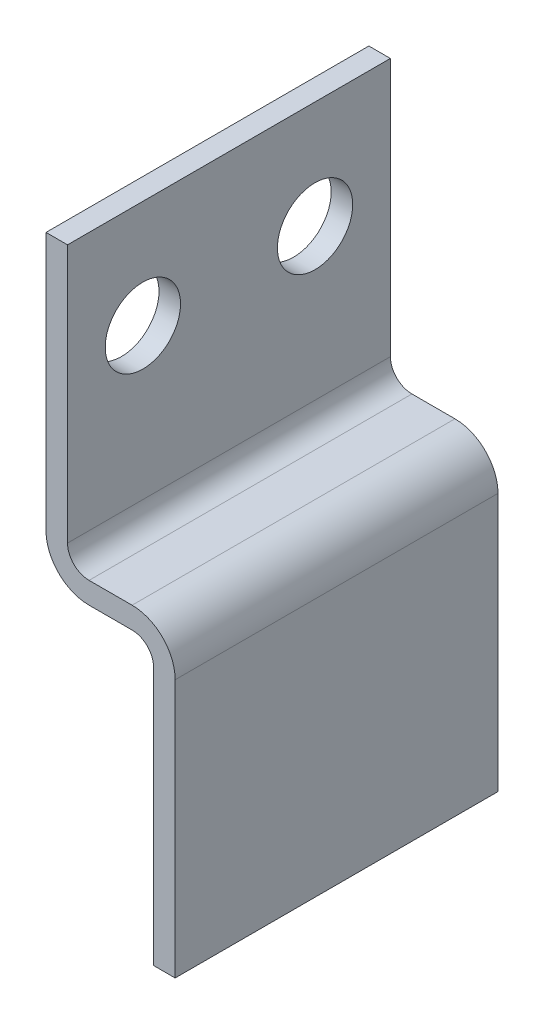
ISO-10303-21;
HEADER;
FILE_DESCRIPTION(('STEP AP214'),'2;1');
FILE_NAME('part.step','',(''),(''),'','','');
FILE_SCHEMA(('AUTOMOTIVE_DESIGN { 1 0 10303 214 1 1 1 1 }'));
ENDSEC;
DATA;
#1=APPLICATION_CONTEXT('core data for automotive mechanical design processes');
#2=APPLICATION_PROTOCOL_DEFINITION('international standard','automotive_design',2000,#1);
#3=PRODUCT_CONTEXT('',#1,'mechanical');
#4=PRODUCT('Part','Part','',(#3));
#5=PRODUCT_RELATED_PRODUCT_CATEGORY('part','',(#4));
#6=PRODUCT_DEFINITION_FORMATION('','',#4);
#7=PRODUCT_DEFINITION_CONTEXT('part definition',#1,'design');
#8=PRODUCT_DEFINITION('design','',#6,#7);
#9=PRODUCT_DEFINITION_SHAPE('','',#8);
#10=(LENGTH_UNIT() NAMED_UNIT(*) SI_UNIT(.MILLI.,.METRE.));
#11=(NAMED_UNIT(*) PLANE_ANGLE_UNIT() SI_UNIT($,.RADIAN.));
#12=(NAMED_UNIT(*) SI_UNIT($,.STERADIAN.) SOLID_ANGLE_UNIT());
#13=UNCERTAINTY_MEASURE_WITH_UNIT(LENGTH_MEASURE(1.E-05),#10,'distance_accuracy_value','');
#14=(GEOMETRIC_REPRESENTATION_CONTEXT(3) GLOBAL_UNCERTAINTY_ASSIGNED_CONTEXT((#13)) GLOBAL_UNIT_ASSIGNED_CONTEXT((#10,
#11,#12)) REPRESENTATION_CONTEXT('',''));
#15=CARTESIAN_POINT('',(0.,0.,0.));
#16=DIRECTION('',(0.,0.,1.));
#17=DIRECTION('',(1.,0.,0.));
#18=AXIS2_PLACEMENT_3D('',#15,#16,#17);
#19=CARTESIAN_POINT('',(4.,-1.,-7.5));
#20=DIRECTION('',(0.,0.,1.));
#21=DIRECTION('',(0.,-1.,0.));
#22=AXIS2_PLACEMENT_3D('',#19,#20,#21);
#23=CYLINDRICAL_SURFACE('',#22,1.);
#24=DIRECTION('',(0.,0.,-1.));
#25=VECTOR('',#24,1.);
#26=CARTESIAN_POINT('',(5.,-1.,0.));
#27=LINE('',#26,#25);
#28=CARTESIAN_POINT('',(4.999999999,-1.,7.5));
#29=VERTEX_POINT('',#28);
#30=CARTESIAN_POINT('',(4.999999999,-1.,-7.5));
#31=VERTEX_POINT('',#30);
#32=EDGE_CURVE('E105',#29,#31,#27,.T.);
#33=ORIENTED_EDGE('',*,*,#32,.F.);
#34=CARTESIAN_POINT('',(4.,-1.00000000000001,7.5));
#35=DIRECTION('',(0.,0.,1.));
#36=DIRECTION('',(0.,-1.,0.));
#37=AXIS2_PLACEMENT_3D('',#34,#35,#36);
#38=CIRCLE('',#37,1.);
#39=CARTESIAN_POINT('',(4.,-6.49999888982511E-09,7.5));
#40=VERTEX_POINT('',#39);
#41=EDGE_CURVE('E110',#29,#40,#38,.T.);
#42=ORIENTED_EDGE('',*,*,#41,.T.);
#43=DIRECTION('',(0.,0.,1.));
#44=VECTOR('',#43,1.);
#45=CARTESIAN_POINT('',(4.,0.,0.));
#46=LINE('',#45,#44);
#47=CARTESIAN_POINT('',(4.,-6.49999888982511E-09,-7.5));
#48=VERTEX_POINT('',#47);
#49=EDGE_CURVE('E108',#48,#40,#46,.T.);
#50=ORIENTED_EDGE('',*,*,#49,.F.);
#51=CARTESIAN_POINT('',(4.,-1.,-7.5));
#52=DIRECTION('',(0.,0.,1.));
#53=DIRECTION('',(0.,-1.,0.));
#54=AXIS2_PLACEMENT_3D('',#51,#52,#53);
#55=CIRCLE('',#54,1.);
#56=EDGE_CURVE('E21',#48,#31,#55,.F.);
#57=ORIENTED_EDGE('',*,*,#56,.T.);
#58=EDGE_LOOP('',(#33,#42,#50,#57));
#59=FACE_BOUND('',#58,.T.);
#60=ADVANCED_FACE('F17',(#59),#23,.F.);
#61=CARTESIAN_POINT('',(5.,-13.,7.5));
#62=DIRECTION('',(0.,-1.,0.));
#63=DIRECTION('',(0.,0.,-1.));
#64=AXIS2_PLACEMENT_3D('',#61,#62,#63);
#65=PLANE('',#64);
#66=DIRECTION('',(0.,0.,-1.));
#67=VECTOR('',#66,1.);
#68=CARTESIAN_POINT('',(6.,-13.,0.));
#69=LINE('',#68,#67);
#70=CARTESIAN_POINT('',(6.,-13.,7.5));
#71=VERTEX_POINT('',#70);
#72=CARTESIAN_POINT('',(6.,-13.,-7.5));
#73=VERTEX_POINT('',#72);
#74=EDGE_CURVE('E203',#71,#73,#69,.T.);
#75=ORIENTED_EDGE('',*,*,#74,.F.);
#76=DIRECTION('',(-1.,0.,0.));
#77=VECTOR('',#76,1.);
#78=CARTESIAN_POINT('',(5.5,-13.,7.5));
#79=LINE('',#78,#77);
#80=CARTESIAN_POINT('',(4.99999999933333,-13.,7.5));
#81=VERTEX_POINT('',#80);
#82=EDGE_CURVE('E212',#71,#81,#79,.T.);
#83=ORIENTED_EDGE('',*,*,#82,.T.);
#84=DIRECTION('',(0.,0.,1.));
#85=VECTOR('',#84,1.);
#86=CARTESIAN_POINT('',(5.,-13.,0.));
#87=LINE('',#86,#85);
#88=CARTESIAN_POINT('',(4.99999999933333,-13.,-7.5));
#89=VERTEX_POINT('',#88);
#90=EDGE_CURVE('E118',#89,#81,#87,.T.);
#91=ORIENTED_EDGE('',*,*,#90,.F.);
#92=DIRECTION('',(1.,0.,0.));
#93=VECTOR('',#92,1.);
#94=CARTESIAN_POINT('',(5.5,-13.,-7.5));
#95=LINE('',#94,#93);
#96=EDGE_CURVE('E122',#89,#73,#95,.T.);
#97=ORIENTED_EDGE('',*,*,#96,.T.);
#98=EDGE_LOOP('',(#75,#83,#91,#97));
#99=FACE_BOUND('',#98,.T.);
#100=ADVANCED_FACE('F276',(#99),#65,.T.);
#101=CARTESIAN_POINT('',(2.,0.,7.5));
#102=DIRECTION('',(0.,-1.,0.));
#103=DIRECTION('',(0.,0.,-1.));
#104=AXIS2_PLACEMENT_3D('',#101,#102,#103);
#105=PLANE('',#104);
#106=DIRECTION('',(1.,0.,0.));
#107=VECTOR('',#106,1.);
#108=CARTESIAN_POINT('',(3.,-1.29999977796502E-08,7.5));
#109=LINE('',#108,#107);
#110=CARTESIAN_POINT('',(2.00000000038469,-6.49999888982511E-09,7.5));
#111=VERTEX_POINT('',#110);
#112=EDGE_CURVE('E159',#111,#40,#109,.T.);
#113=ORIENTED_EDGE('',*,*,#112,.F.);
#114=DIRECTION('',(0.,0.,1.));
#115=VECTOR('',#114,1.);
#116=CARTESIAN_POINT('',(2.00000000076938,0.,0.));
#117=LINE('',#116,#115);
#118=CARTESIAN_POINT('',(2.00000000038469,-6.49999888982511E-09,-7.5));
#119=VERTEX_POINT('',#118);
#120=EDGE_CURVE('E172',#111,#119,#117,.F.);
#121=ORIENTED_EDGE('',*,*,#120,.T.);
#122=DIRECTION('',(1.,0.,0.));
#123=VECTOR('',#122,1.);
#124=CARTESIAN_POINT('',(3.,-1.29999977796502E-08,-7.5));
#125=LINE('',#124,#123);
#126=EDGE_CURVE('E125',#119,#48,#125,.T.);
#127=ORIENTED_EDGE('',*,*,#126,.T.);
#128=ORIENTED_EDGE('',*,*,#49,.T.);
#129=EDGE_LOOP('',(#113,#121,#127,#128));
#130=FACE_BOUND('',#129,.T.);
#131=ADVANCED_FACE('F240',(#130),#105,.T.);
#132=CARTESIAN_POINT('',(5.,-13.,-7.5));
#133=DIRECTION('',(-1.,0.,0.));
#134=DIRECTION('',(0.,0.,1.));
#135=AXIS2_PLACEMENT_3D('',#132,#133,#134);
#136=PLANE('',#135);
#137=DIRECTION('',(0.,-1.,0.));
#138=VECTOR('',#137,1.);
#139=CARTESIAN_POINT('',(4.999999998,0.5,-7.5));
#140=LINE('',#139,#138);
#141=EDGE_CURVE('E115',#31,#89,#140,.T.);
#142=ORIENTED_EDGE('',*,*,#141,.T.);
#143=ORIENTED_EDGE('',*,*,#90,.T.);
#144=DIRECTION('',(0.,-1.,0.));
#145=VECTOR('',#144,1.);
#146=CARTESIAN_POINT('',(4.999999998,0.5,7.5));
#147=LINE('',#146,#145);
#148=EDGE_CURVE('E117',#29,#81,#147,.T.);
#149=ORIENTED_EDGE('',*,*,#148,.F.);
#150=ORIENTED_EDGE('',*,*,#32,.T.);
#151=EDGE_LOOP('',(#142,#143,#149,#150));
#152=FACE_BOUND('',#151,.T.);
#153=ADVANCED_FACE('F113',(#152),#136,.T.);
#154=CARTESIAN_POINT('',(6.,-13.,7.5));
#155=DIRECTION('',(1.,0.,0.));
#156=DIRECTION('',(0.,0.,-1.));
#157=AXIS2_PLACEMENT_3D('',#154,#155,#156);
#158=PLANE('',#157);
#159=DIRECTION('',(0.,1.,0.));
#160=VECTOR('',#159,1.);
#161=CARTESIAN_POINT('',(6.,0.5,7.5));
#162=LINE('',#161,#160);
#163=CARTESIAN_POINT('',(6.,-1.00000000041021,7.5));
#164=VERTEX_POINT('',#163);
#165=EDGE_CURVE('E167',#71,#164,#162,.T.);
#166=ORIENTED_EDGE('',*,*,#165,.F.);
#167=ORIENTED_EDGE('',*,*,#74,.T.);
#168=DIRECTION('',(0.,1.,0.));
#169=VECTOR('',#168,1.);
#170=CARTESIAN_POINT('',(6.,0.5,-7.5));
#171=LINE('',#170,#169);
#172=CARTESIAN_POINT('',(6.,-1.00000000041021,-7.5));
#173=VERTEX_POINT('',#172);
#174=EDGE_CURVE('E124',#73,#173,#171,.T.);
#175=ORIENTED_EDGE('',*,*,#174,.T.);
#176=DIRECTION('',(0.,0.,-1.));
#177=VECTOR('',#176,1.);
#178=CARTESIAN_POINT('',(6.,-1.00000000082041,0.));
#179=LINE('',#178,#177);
#180=EDGE_CURVE('E200',#173,#164,#179,.F.);
#181=ORIENTED_EDGE('',*,*,#180,.T.);
#182=EDGE_LOOP('',(#166,#167,#175,#181));
#183=FACE_BOUND('',#182,.T.);
#184=ADVANCED_FACE('F273',(#183),#158,.T.);
#185=CARTESIAN_POINT('',(4.,-1.,7.5));
#186=DIRECTION('',(0.,0.,-1.));
#187=DIRECTION('',(0.,1.,0.));
#188=AXIS2_PLACEMENT_3D('',#185,#186,#187);
#189=CYLINDRICAL_SURFACE('',#188,2.);
#190=CARTESIAN_POINT('',(4.,-1.,-7.5));
#191=DIRECTION('',(0.,0.,-1.));
#192=DIRECTION('',(0.,1.,0.));
#193=AXIS2_PLACEMENT_3D('',#190,#191,#192);
#194=CIRCLE('',#193,2.);
#195=CARTESIAN_POINT('',(4.,1.0000000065,-7.5));
#196=VERTEX_POINT('',#195);
#197=EDGE_CURVE('E128',#173,#196,#194,.F.);
#198=ORIENTED_EDGE('',*,*,#197,.T.);
#199=DIRECTION('',(0.,0.,-1.));
#200=VECTOR('',#199,1.);
#201=CARTESIAN_POINT('',(4.,1.,0.));
#202=LINE('',#201,#200);
#203=CARTESIAN_POINT('',(4.,1.0000000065,7.5));
#204=VERTEX_POINT('',#203);
#205=EDGE_CURVE('E198',#204,#196,#202,.T.);
#206=ORIENTED_EDGE('',*,*,#205,.F.);
#207=CARTESIAN_POINT('',(4.,-1.,7.5));
#208=DIRECTION('',(0.,0.,-1.));
#209=DIRECTION('',(0.,1.,0.));
#210=AXIS2_PLACEMENT_3D('',#207,#208,#209);
#211=CIRCLE('',#210,2.);
#212=EDGE_CURVE('E166',#164,#204,#211,.F.);
#213=ORIENTED_EDGE('',*,*,#212,.F.);
#214=ORIENTED_EDGE('',*,*,#180,.F.);
#215=EDGE_LOOP('',(#198,#206,#213,#214));
#216=FACE_BOUND('',#215,.T.);
#217=ADVANCED_FACE('F270',(#216),#189,.T.);
#218=CARTESIAN_POINT('',(2.,1.,-7.5));
#219=DIRECTION('',(0.,1.,0.));
#220=DIRECTION('',(0.,0.,1.));
#221=AXIS2_PLACEMENT_3D('',#218,#219,#220);
#222=PLANE('',#221);
#223=DIRECTION('',(-1.,0.,0.));
#224=VECTOR('',#223,1.);
#225=CARTESIAN_POINT('',(3.,1.000000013,7.5));
#226=LINE('',#225,#224);
#227=CARTESIAN_POINT('',(1.99999999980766,1.0000000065,7.5));
#228=VERTEX_POINT('',#227);
#229=EDGE_CURVE('E164',#204,#228,#226,.T.);
#230=ORIENTED_EDGE('',*,*,#229,.F.);
#231=ORIENTED_EDGE('',*,*,#205,.T.);
#232=DIRECTION('',(-1.,0.,0.));
#233=VECTOR('',#232,1.);
#234=CARTESIAN_POINT('',(3.,1.000000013,-7.5));
#235=LINE('',#234,#233);
#236=CARTESIAN_POINT('',(1.99999999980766,1.0000000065,-7.5));
#237=VERTEX_POINT('',#236);
#238=EDGE_CURVE('E228',#196,#237,#235,.T.);
#239=ORIENTED_EDGE('',*,*,#238,.T.);
#240=DIRECTION('',(0.,0.,1.));
#241=VECTOR('',#240,1.);
#242=CARTESIAN_POINT('',(1.99999999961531,1.,0.));
#243=LINE('',#242,#241);
#244=EDGE_CURVE('E162',#228,#237,#243,.F.);
#245=ORIENTED_EDGE('',*,*,#244,.F.);
#246=EDGE_LOOP('',(#230,#231,#239,#245));
#247=FACE_BOUND('',#246,.T.);
#248=ADVANCED_FACE('F265',(#247),#222,.T.);
#249=CARTESIAN_POINT('',(2.,2.,7.5));
#250=DIRECTION('',(0.,0.,-1.));
#251=DIRECTION('',(0.,1.,0.));
#252=AXIS2_PLACEMENT_3D('',#249,#250,#251);
#253=CYLINDRICAL_SURFACE('',#252,2.);
#254=CARTESIAN_POINT('',(2.,2.,-7.5));
#255=DIRECTION('',(0.,0.,-1.));
#256=DIRECTION('',(0.,1.,0.));
#257=AXIS2_PLACEMENT_3D('',#254,#255,#256);
#258=CIRCLE('',#257,2.);
#259=CARTESIAN_POINT('',(0.,2.,-7.5));
#260=VERTEX_POINT('',#259);
#261=EDGE_CURVE('E130',#260,#119,#258,.F.);
#262=ORIENTED_EDGE('',*,*,#261,.T.);
#263=ORIENTED_EDGE('',*,*,#120,.F.);
#264=CARTESIAN_POINT('',(2.,2.,7.5));
#265=DIRECTION('',(0.,0.,-1.));
#266=DIRECTION('',(0.,1.,0.));
#267=AXIS2_PLACEMENT_3D('',#264,#265,#266);
#268=CIRCLE('',#267,2.);
#269=CARTESIAN_POINT('',(0.,2.,7.5));
#270=VERTEX_POINT('',#269);
#271=EDGE_CURVE('E163',#270,#111,#268,.F.);
#272=ORIENTED_EDGE('',*,*,#271,.F.);
#273=DIRECTION('',(0.,0.,1.));
#274=VECTOR('',#273,1.);
#275=CARTESIAN_POINT('',(0.,2.,0.));
#276=LINE('',#275,#274);
#277=EDGE_CURVE('E180',#260,#270,#276,.T.);
#278=ORIENTED_EDGE('',*,*,#277,.F.);
#279=EDGE_LOOP('',(#262,#263,#272,#278));
#280=FACE_BOUND('',#279,.T.);
#281=ADVANCED_FACE('F247',(#280),#253,.T.);
#282=CARTESIAN_POINT('',(0.,-13.,7.5));
#283=DIRECTION('',(0.,0.,1.));
#284=DIRECTION('',(1.,0.,0.));
#285=AXIS2_PLACEMENT_3D('',#282,#283,#284);
#286=PLANE('',#285);
#287=ORIENTED_EDGE('',*,*,#271,.T.);
#288=ORIENTED_EDGE('',*,*,#112,.T.);
#289=ORIENTED_EDGE('',*,*,#41,.F.);
#290=ORIENTED_EDGE('',*,*,#148,.T.);
#291=ORIENTED_EDGE('',*,*,#82,.F.);
#292=ORIENTED_EDGE('',*,*,#165,.T.);
#293=ORIENTED_EDGE('',*,*,#212,.T.);
#294=ORIENTED_EDGE('',*,*,#229,.T.);
#295=CARTESIAN_POINT('',(2.,1.99999999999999,7.5));
#296=DIRECTION('',(0.,0.,1.));
#297=DIRECTION('',(0.,-1.,0.));
#298=AXIS2_PLACEMENT_3D('',#295,#296,#297);
#299=CIRCLE('',#298,1.);
#300=CARTESIAN_POINT('',(1.,2.,7.5));
#301=VERTEX_POINT('',#300);
#302=EDGE_CURVE('E197',#301,#228,#299,.T.);
#303=ORIENTED_EDGE('',*,*,#302,.F.);
#304=DIRECTION('',(0.,-1.,0.));
#305=VECTOR('',#304,1.);
#306=CARTESIAN_POINT('',(1.,8.,7.5));
#307=LINE('',#306,#305);
#308=CARTESIAN_POINT('',(1.,14.,7.5));
#309=VERTEX_POINT('',#308);
#310=EDGE_CURVE('E139',#309,#301,#307,.T.);
#311=ORIENTED_EDGE('',*,*,#310,.F.);
#312=DIRECTION('',(1.,0.,0.));
#313=VECTOR('',#312,1.);
#314=CARTESIAN_POINT('',(0.5,14.,7.5));
#315=LINE('',#314,#313);
#316=CARTESIAN_POINT('',(0.,14.,7.5));
#317=VERTEX_POINT('',#316);
#318=EDGE_CURVE('E147',#317,#309,#315,.T.);
#319=ORIENTED_EDGE('',*,*,#318,.F.);
#320=DIRECTION('',(0.,1.,0.));
#321=VECTOR('',#320,1.);
#322=CARTESIAN_POINT('',(0.,8.,7.5));
#323=LINE('',#322,#321);
#324=EDGE_CURVE('E182',#270,#317,#323,.T.);
#325=ORIENTED_EDGE('',*,*,#324,.F.);
#326=EDGE_LOOP('',(#287,#288,#289,#290,#291,#292,#293,#294,#303,#311,#319,#325));
#327=FACE_BOUND('',#326,.T.);
#328=ADVANCED_FACE('F241',(#327),#286,.T.);
#329=CARTESIAN_POINT('',(2.,2.,-7.5));
#330=DIRECTION('',(0.,0.,1.));
#331=DIRECTION('',(0.,-1.,0.));
#332=AXIS2_PLACEMENT_3D('',#329,#330,#331);
#333=CYLINDRICAL_SURFACE('',#332,1.);
#334=DIRECTION('',(0.,0.,-1.));
#335=VECTOR('',#334,1.);
#336=CARTESIAN_POINT('',(1.,2.,0.));
#337=LINE('',#336,#335);
#338=CARTESIAN_POINT('',(1.,2.,-7.5));
#339=VERTEX_POINT('',#338);
#340=EDGE_CURVE('E137',#301,#339,#337,.T.);
#341=ORIENTED_EDGE('',*,*,#340,.F.);
#342=ORIENTED_EDGE('',*,*,#302,.T.);
#343=ORIENTED_EDGE('',*,*,#244,.T.);
#344=CARTESIAN_POINT('',(2.,2.,-7.5));
#345=DIRECTION('',(0.,0.,1.));
#346=DIRECTION('',(0.,-1.,0.));
#347=AXIS2_PLACEMENT_3D('',#344,#345,#346);
#348=CIRCLE('',#347,1.);
#349=EDGE_CURVE('E148',#237,#339,#348,.F.);
#350=ORIENTED_EDGE('',*,*,#349,.T.);
#351=EDGE_LOOP('',(#341,#342,#343,#350));
#352=FACE_BOUND('',#351,.T.);
#353=ADVANCED_FACE('F279',(#352),#333,.F.);
#354=CARTESIAN_POINT('',(0.,-13.,-7.5));
#355=DIRECTION('',(0.,0.,1.));
#356=DIRECTION('',(1.,0.,0.));
#357=AXIS2_PLACEMENT_3D('',#354,#355,#356);
#358=PLANE('',#357);
#359=DIRECTION('',(-1.,0.,0.));
#360=VECTOR('',#359,1.);
#361=CARTESIAN_POINT('',(0.5,14.,-7.5));
#362=LINE('',#361,#360);
#363=CARTESIAN_POINT('',(1.,14.,-7.5));
#364=VERTEX_POINT('',#363);
#365=CARTESIAN_POINT('',(0.,14.,-7.5));
#366=VERTEX_POINT('',#365);
#367=EDGE_CURVE('E144',#364,#366,#362,.T.);
#368=ORIENTED_EDGE('',*,*,#367,.F.);
#369=DIRECTION('',(0.,1.,0.));
#370=VECTOR('',#369,1.);
#371=CARTESIAN_POINT('',(1.,8.,-7.5));
#372=LINE('',#371,#370);
#373=EDGE_CURVE('E36',#339,#364,#372,.T.);
#374=ORIENTED_EDGE('',*,*,#373,.F.);
#375=ORIENTED_EDGE('',*,*,#349,.F.);
#376=ORIENTED_EDGE('',*,*,#238,.F.);
#377=ORIENTED_EDGE('',*,*,#197,.F.);
#378=ORIENTED_EDGE('',*,*,#174,.F.);
#379=ORIENTED_EDGE('',*,*,#96,.F.);
#380=ORIENTED_EDGE('',*,*,#141,.F.);
#381=ORIENTED_EDGE('',*,*,#56,.F.);
#382=ORIENTED_EDGE('',*,*,#126,.F.);
#383=ORIENTED_EDGE('',*,*,#261,.F.);
#384=DIRECTION('',(0.,-1.,0.));
#385=VECTOR('',#384,1.);
#386=CARTESIAN_POINT('',(0.,8.,-7.5));
#387=LINE('',#386,#385);
#388=EDGE_CURVE('E177',#366,#260,#387,.T.);
#389=ORIENTED_EDGE('',*,*,#388,.F.);
#390=EDGE_LOOP('',(#368,#374,#375,#376,#377,#378,#379,#380,#381,#382,#383,#389));
#391=FACE_BOUND('',#390,.T.);
#392=ADVANCED_FACE('F120',(#391),#358,.F.);
#393=CARTESIAN_POINT('',(0.,14.,-7.5));
#394=DIRECTION('',(0.,1.,0.));
#395=DIRECTION('',(0.,0.,1.));
#396=AXIS2_PLACEMENT_3D('',#393,#394,#395);
#397=PLANE('',#396);
#398=DIRECTION('',(0.,0.,-1.));
#399=VECTOR('',#398,1.);
#400=CARTESIAN_POINT('',(0.,14.,0.));
#401=LINE('',#400,#399);
#402=EDGE_CURVE('E185',#317,#366,#401,.T.);
#403=ORIENTED_EDGE('',*,*,#402,.F.);
#404=ORIENTED_EDGE('',*,*,#318,.T.);
#405=DIRECTION('',(0.,0.,1.));
#406=VECTOR('',#405,1.);
#407=CARTESIAN_POINT('',(1.,14.,0.));
#408=LINE('',#407,#406);
#409=EDGE_CURVE('E141',#364,#309,#408,.T.);
#410=ORIENTED_EDGE('',*,*,#409,.F.);
#411=ORIENTED_EDGE('',*,*,#367,.T.);
#412=EDGE_LOOP('',(#403,#404,#410,#411));
#413=FACE_BOUND('',#412,.T.);
#414=ADVANCED_FACE('F253',(#413),#397,.T.);
#415=CARTESIAN_POINT('',(0.,9.,-4.));
#416=DIRECTION('',(1.,0.,0.));
#417=DIRECTION('',(0.,0.,-1.));
#418=AXIS2_PLACEMENT_3D('',#415,#416,#417);
#419=CYLINDRICAL_SURFACE('',#418,1.75);
#420=CARTESIAN_POINT('',(0.,9.,-4.));
#421=DIRECTION('',(1.,0.,0.));
#422=DIRECTION('',(0.,0.,-1.));
#423=AXIS2_PLACEMENT_3D('',#420,#421,#422);
#424=CIRCLE('',#423,1.75);
#425=CARTESIAN_POINT('',(0.,9.,-5.75));
#426=VERTEX_POINT('',#425);
#427=EDGE_CURVE('E156',#426,#426,#424,.T.);
#428=ORIENTED_EDGE('',*,*,#427,.F.);
#429=EDGE_LOOP('',(#428));
#430=FACE_BOUND('',#429,.T.);
#431=CARTESIAN_POINT('',(1.,9.,-4.));
#432=DIRECTION('',(1.,0.,0.));
#433=DIRECTION('',(0.,0.,-1.));
#434=AXIS2_PLACEMENT_3D('',#431,#432,#433);
#435=CIRCLE('',#434,1.75);
#436=CARTESIAN_POINT('',(1.,9.,-5.75));
#437=VERTEX_POINT('',#436);
#438=EDGE_CURVE('E152',#437,#437,#435,.F.);
#439=ORIENTED_EDGE('',*,*,#438,.F.);
#440=EDGE_LOOP('',(#439));
#441=FACE_BOUND('',#440,.T.);
#442=ADVANCED_FACE('F290',(#430,#441),#419,.F.);
#443=CARTESIAN_POINT('',(0.,2.,-7.5));
#444=DIRECTION('',(-1.,0.,0.));
#445=DIRECTION('',(0.,0.,1.));
#446=AXIS2_PLACEMENT_3D('',#443,#444,#445);
#447=PLANE('',#446);
#448=ORIENTED_EDGE('',*,*,#427,.T.);
#449=EDGE_LOOP('',(#448));
#450=FACE_BOUND('',#449,.T.);
#451=CARTESIAN_POINT('',(0.,9.,4.));
#452=DIRECTION('',(1.,0.,0.));
#453=DIRECTION('',(0.,0.,-1.));
#454=AXIS2_PLACEMENT_3D('',#451,#452,#453);
#455=CIRCLE('',#454,1.75);
#456=CARTESIAN_POINT('',(0.,9.,2.25));
#457=VERTEX_POINT('',#456);
#458=EDGE_CURVE('E27',#457,#457,#455,.F.);
#459=ORIENTED_EDGE('',*,*,#458,.F.);
#460=EDGE_LOOP('',(#459));
#461=FACE_BOUND('',#460,.T.);
#462=ORIENTED_EDGE('',*,*,#324,.T.);
#463=ORIENTED_EDGE('',*,*,#402,.T.);
#464=ORIENTED_EDGE('',*,*,#388,.T.);
#465=ORIENTED_EDGE('',*,*,#277,.T.);
#466=EDGE_LOOP('',(#462,#463,#464,#465));
#467=FACE_BOUND('',#466,.T.);
#468=ADVANCED_FACE('F250',(#450,#461,#467),#447,.T.);
#469=CARTESIAN_POINT('',(1.,2.,7.5));
#470=DIRECTION('',(1.,0.,0.));
#471=DIRECTION('',(0.,0.,-1.));
#472=AXIS2_PLACEMENT_3D('',#469,#470,#471);
#473=PLANE('',#472);
#474=ORIENTED_EDGE('',*,*,#438,.T.);
#475=EDGE_LOOP('',(#474));
#476=FACE_BOUND('',#475,.T.);
#477=CARTESIAN_POINT('',(1.,9.,4.));
#478=DIRECTION('',(1.,0.,0.));
#479=DIRECTION('',(0.,0.,-1.));
#480=AXIS2_PLACEMENT_3D('',#477,#478,#479);
#481=CIRCLE('',#480,1.75);
#482=CARTESIAN_POINT('',(1.,9.,2.25));
#483=VERTEX_POINT('',#482);
#484=EDGE_CURVE('E11',#483,#483,#481,.T.);
#485=ORIENTED_EDGE('',*,*,#484,.F.);
#486=EDGE_LOOP('',(#485));
#487=FACE_BOUND('',#486,.T.);
#488=ORIENTED_EDGE('',*,*,#373,.T.);
#489=ORIENTED_EDGE('',*,*,#409,.T.);
#490=ORIENTED_EDGE('',*,*,#310,.T.);
#491=ORIENTED_EDGE('',*,*,#340,.T.);
#492=EDGE_LOOP('',(#488,#489,#490,#491));
#493=FACE_BOUND('',#492,.T.);
#494=ADVANCED_FACE('F19',(#476,#487,#493),#473,.T.);
#495=CARTESIAN_POINT('',(0.,9.,4.));
#496=DIRECTION('',(1.,0.,0.));
#497=DIRECTION('',(0.,0.,-1.));
#498=AXIS2_PLACEMENT_3D('',#495,#496,#497);
#499=CYLINDRICAL_SURFACE('',#498,1.75);
#500=ORIENTED_EDGE('',*,*,#458,.T.);
#501=EDGE_LOOP('',(#500));
#502=FACE_BOUND('',#501,.T.);
#503=ORIENTED_EDGE('',*,*,#484,.T.);
#504=EDGE_LOOP('',(#503));
#505=FACE_BOUND('',#504,.T.);
#506=ADVANCED_FACE('F281',(#502,#505),#499,.F.);
#507=CLOSED_SHELL('',(#60,#100,#131,#153,#184,#217,#248,#281,#328,#353,#392,#414,#442,#468,#494,#506));
#508=MANIFOLD_SOLID_BREP('B1',#507);
#509=ADVANCED_BREP_SHAPE_REPRESENTATION('',(#18,#508),#14);
#510=SHAPE_DEFINITION_REPRESENTATION(#9,#509);
ENDSEC;
END-ISO-10303-21;
